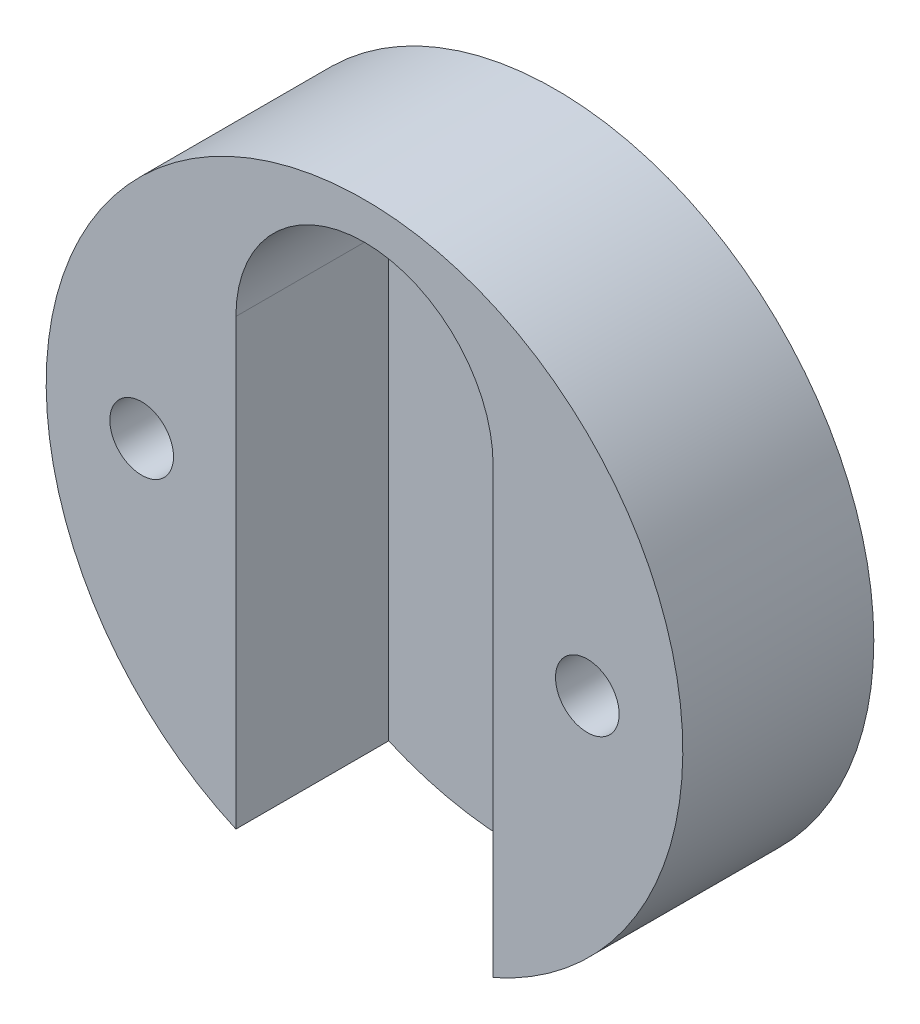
from build123d import *

# Parameters (mm, degrees)
ESQUISSE1_R             = 25
EXTRUSION1_DEPTH        = 15
ENL_V_MAT_EXTRU_1_DEPTH = 12
TROU_TARAUD_M6X1_01_D   = 5


with BuildPart() as part:
    # Esquisse1 → Extrusion1 (new body)
    with BuildSketch(Plane.XY):
        Circle(ESQUISSE1_R)
    extrude(amount=EXTRUSION1_DEPTH)

    # Esquisse2 → Enl_v. mat.-Extru.1 (cut)
    with BuildSketch(Plane.XY.offset(15)):
        with BuildLine():
            Line((-10.1, -25), (-10.1, 12))
            ThreePointArc((-10.1, 12), (0, 22.1), (10.1, 12))
            Line((10.1, 12), (10.1, -25))
            Line((10.1, -25), (-10.1, -25))
        make_face()
    extrude(amount=-ENL_V_MAT_EXTRU_1_DEPTH, mode=Mode.SUBTRACT)

    # Trou taraud_ M6x1.01 (through all)
    with Locations(Plane.XY.offset(15)):
        with Locations((17.5, 0), (-17.5, 0)):
            Hole(TROU_TARAUD_M6X1_01_D / 2)


solid = part.part
